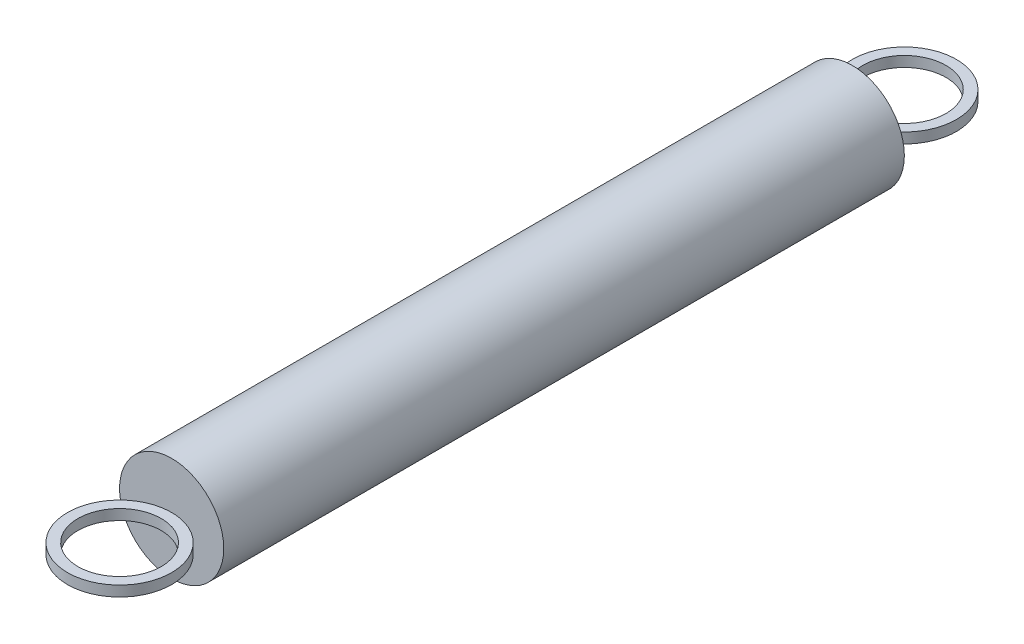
ISO-10303-21;
HEADER;
FILE_DESCRIPTION(('STEP AP214'),'2;1');
FILE_NAME('part.step','',(''),(''),'','','');
FILE_SCHEMA(('AUTOMOTIVE_DESIGN { 1 0 10303 214 1 1 1 1 }'));
ENDSEC;
DATA;
#1=APPLICATION_CONTEXT('core data for automotive mechanical design processes');
#2=APPLICATION_PROTOCOL_DEFINITION('international standard','automotive_design',2000,#1);
#3=PRODUCT_CONTEXT('',#1,'mechanical');
#4=PRODUCT('Part','Part','',(#3));
#5=PRODUCT_RELATED_PRODUCT_CATEGORY('part','',(#4));
#6=PRODUCT_DEFINITION_FORMATION('','',#4);
#7=PRODUCT_DEFINITION_CONTEXT('part definition',#1,'design');
#8=PRODUCT_DEFINITION('design','',#6,#7);
#9=PRODUCT_DEFINITION_SHAPE('','',#8);
#10=(LENGTH_UNIT() NAMED_UNIT(*) SI_UNIT(.MILLI.,.METRE.));
#11=(NAMED_UNIT(*) PLANE_ANGLE_UNIT() SI_UNIT($,.RADIAN.));
#12=(NAMED_UNIT(*) SI_UNIT($,.STERADIAN.) SOLID_ANGLE_UNIT());
#13=UNCERTAINTY_MEASURE_WITH_UNIT(LENGTH_MEASURE(1.E-05),#10,'distance_accuracy_value','');
#14=(GEOMETRIC_REPRESENTATION_CONTEXT(3) GLOBAL_UNCERTAINTY_ASSIGNED_CONTEXT((#13)) GLOBAL_UNIT_ASSIGNED_CONTEXT((#10,
#11,#12)) REPRESENTATION_CONTEXT('',''));
#15=CARTESIAN_POINT('',(0.,0.,0.));
#16=DIRECTION('',(0.,0.,1.));
#17=DIRECTION('',(1.,0.,0.));
#18=AXIS2_PLACEMENT_3D('',#15,#16,#17);
#19=CARTESIAN_POINT('',(0.,0.228599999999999,17.2212));
#20=DIRECTION('',(0.,1.,0.));
#21=DIRECTION('',(0.,0.,1.));
#22=AXIS2_PLACEMENT_3D('',#19,#20,#21);
#23=PLANE('',#22);
#24=CARTESIAN_POINT('',(0.,0.228599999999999,17.2212));
#25=DIRECTION('',(0.,1.,0.));
#26=DIRECTION('',(0.,0.,1.));
#27=AXIS2_PLACEMENT_3D('',#24,#25,#26);
#28=CIRCLE('',#27,2.286);
#29=CARTESIAN_POINT('',(0.,0.228599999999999,19.5072));
#30=VERTEX_POINT('',#29);
#31=EDGE_CURVE('E11',#30,#30,#28,.T.);
#32=ORIENTED_EDGE('',*,*,#31,.T.);
#33=EDGE_LOOP('',(#32));
#34=FACE_BOUND('',#33,.T.);
#35=CARTESIAN_POINT('',(0.,0.228599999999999,17.2212));
#36=DIRECTION('',(0.,1.,0.));
#37=DIRECTION('',(0.,0.,1.));
#38=AXIS2_PLACEMENT_3D('',#35,#36,#37);
#39=CIRCLE('',#38,1.8288);
#40=CARTESIAN_POINT('',(0.,0.228599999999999,19.05));
#41=VERTEX_POINT('',#40);
#42=EDGE_CURVE('E44',#41,#41,#39,.T.);
#43=ORIENTED_EDGE('',*,*,#42,.F.);
#44=EDGE_LOOP('',(#43));
#45=FACE_BOUND('',#44,.T.);
#46=ADVANCED_FACE('F33',(#34,#45),#23,.T.);
#47=CARTESIAN_POINT('',(0.,-0.228600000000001,17.2212));
#48=DIRECTION('',(0.,1.,0.));
#49=DIRECTION('',(0.,0.,1.));
#50=AXIS2_PLACEMENT_3D('',#47,#48,#49);
#51=PLANE('',#50);
#52=CARTESIAN_POINT('',(0.,-0.228600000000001,17.2212));
#53=DIRECTION('',(0.,1.,0.));
#54=DIRECTION('',(0.,0.,1.));
#55=AXIS2_PLACEMENT_3D('',#52,#53,#54);
#56=CIRCLE('',#55,2.286);
#57=CARTESIAN_POINT('',(0.,-0.228600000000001,19.5072));
#58=VERTEX_POINT('',#57);
#59=EDGE_CURVE('E40',#58,#58,#56,.T.);
#60=ORIENTED_EDGE('',*,*,#59,.F.);
#61=EDGE_LOOP('',(#60));
#62=FACE_BOUND('',#61,.T.);
#63=CARTESIAN_POINT('',(0.,-0.228600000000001,17.2212));
#64=DIRECTION('',(0.,1.,0.));
#65=DIRECTION('',(0.,0.,1.));
#66=AXIS2_PLACEMENT_3D('',#63,#64,#65);
#67=CIRCLE('',#66,1.8288);
#68=CARTESIAN_POINT('',(0.,-0.228600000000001,19.05));
#69=VERTEX_POINT('',#68);
#70=EDGE_CURVE('E48',#69,#69,#67,.T.);
#71=ORIENTED_EDGE('',*,*,#70,.T.);
#72=EDGE_LOOP('',(#71));
#73=FACE_BOUND('',#72,.T.);
#74=ADVANCED_FACE('F54',(#62,#73),#51,.F.);
#75=CARTESIAN_POINT('',(0.,0.228599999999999,17.2212));
#76=DIRECTION('',(0.,-1.,0.));
#77=DIRECTION('',(0.,0.,-1.));
#78=AXIS2_PLACEMENT_3D('',#75,#76,#77);
#79=CYLINDRICAL_SURFACE('',#78,2.286);
#80=ORIENTED_EDGE('',*,*,#31,.F.);
#81=EDGE_LOOP('',(#80));
#82=FACE_BOUND('',#81,.T.);
#83=ORIENTED_EDGE('',*,*,#59,.T.);
#84=EDGE_LOOP('',(#83));
#85=FACE_BOUND('',#84,.T.);
#86=ADVANCED_FACE('F35',(#82,#85),#79,.T.);
#87=CARTESIAN_POINT('',(0.,0.228599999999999,17.2212));
#88=DIRECTION('',(0.,-1.,0.));
#89=DIRECTION('',(0.,0.,-1.));
#90=AXIS2_PLACEMENT_3D('',#87,#88,#89);
#91=CYLINDRICAL_SURFACE('',#90,1.8288);
#92=ORIENTED_EDGE('',*,*,#42,.T.);
#93=EDGE_LOOP('',(#92));
#94=FACE_BOUND('',#93,.T.);
#95=ORIENTED_EDGE('',*,*,#70,.F.);
#96=EDGE_LOOP('',(#95));
#97=FACE_BOUND('',#96,.T.);
#98=ADVANCED_FACE('F56',(#94,#97),#91,.F.);
#99=CLOSED_SHELL('',(#46,#74,#86,#98));
#100=MANIFOLD_SOLID_BREP('B2',#99);
#101=CARTESIAN_POINT('',(0.,0.2286,-17.2212));
#102=DIRECTION('',(0.,1.,0.));
#103=DIRECTION('',(0.,0.,1.));
#104=AXIS2_PLACEMENT_3D('',#101,#102,#103);
#105=PLANE('',#104);
#106=CARTESIAN_POINT('',(0.,0.2286,-17.2212));
#107=DIRECTION('',(0.,1.,0.));
#108=DIRECTION('',(0.,0.,1.));
#109=AXIS2_PLACEMENT_3D('',#106,#107,#108);
#110=CIRCLE('',#109,2.286);
#111=CARTESIAN_POINT('',(0.,0.2286,-14.9352));
#112=VERTEX_POINT('',#111);
#113=EDGE_CURVE('E32',#112,#112,#110,.T.);
#114=ORIENTED_EDGE('',*,*,#113,.T.);
#115=EDGE_LOOP('',(#114));
#116=FACE_BOUND('',#115,.T.);
#117=CARTESIAN_POINT('',(0.,0.2286,-17.2212));
#118=DIRECTION('',(0.,1.,0.));
#119=DIRECTION('',(0.,0.,1.));
#120=AXIS2_PLACEMENT_3D('',#117,#118,#119);
#121=CIRCLE('',#120,1.8288);
#122=CARTESIAN_POINT('',(0.,0.2286,-15.3924));
#123=VERTEX_POINT('',#122);
#124=EDGE_CURVE('E96',#123,#123,#121,.T.);
#125=ORIENTED_EDGE('',*,*,#124,.F.);
#126=EDGE_LOOP('',(#125));
#127=FACE_BOUND('',#126,.T.);
#128=ADVANCED_FACE('F85',(#116,#127),#105,.T.);
#129=CARTESIAN_POINT('',(0.,-0.2286,-17.2212));
#130=DIRECTION('',(0.,1.,0.));
#131=DIRECTION('',(0.,0.,1.));
#132=AXIS2_PLACEMENT_3D('',#129,#130,#131);
#133=PLANE('',#132);
#134=CARTESIAN_POINT('',(0.,-0.2286,-17.2212));
#135=DIRECTION('',(0.,1.,0.));
#136=DIRECTION('',(0.,0.,1.));
#137=AXIS2_PLACEMENT_3D('',#134,#135,#136);
#138=CIRCLE('',#137,2.286);
#139=CARTESIAN_POINT('',(0.,-0.2286,-14.9352));
#140=VERTEX_POINT('',#139);
#141=EDGE_CURVE('E92',#140,#140,#138,.T.);
#142=ORIENTED_EDGE('',*,*,#141,.F.);
#143=EDGE_LOOP('',(#142));
#144=FACE_BOUND('',#143,.T.);
#145=CARTESIAN_POINT('',(0.,-0.2286,-17.2212));
#146=DIRECTION('',(0.,1.,0.));
#147=DIRECTION('',(0.,0.,1.));
#148=AXIS2_PLACEMENT_3D('',#145,#146,#147);
#149=CIRCLE('',#148,1.8288);
#150=CARTESIAN_POINT('',(0.,-0.2286,-15.3924));
#151=VERTEX_POINT('',#150);
#152=EDGE_CURVE('E100',#151,#151,#149,.T.);
#153=ORIENTED_EDGE('',*,*,#152,.T.);
#154=EDGE_LOOP('',(#153));
#155=FACE_BOUND('',#154,.T.);
#156=ADVANCED_FACE('F106',(#144,#155),#133,.F.);
#157=CARTESIAN_POINT('',(0.,0.2286,-17.2212));
#158=DIRECTION('',(0.,-1.,0.));
#159=DIRECTION('',(0.,0.,-1.));
#160=AXIS2_PLACEMENT_3D('',#157,#158,#159);
#161=CYLINDRICAL_SURFACE('',#160,2.286);
#162=ORIENTED_EDGE('',*,*,#113,.F.);
#163=EDGE_LOOP('',(#162));
#164=FACE_BOUND('',#163,.T.);
#165=ORIENTED_EDGE('',*,*,#141,.T.);
#166=EDGE_LOOP('',(#165));
#167=FACE_BOUND('',#166,.T.);
#168=ADVANCED_FACE('F87',(#164,#167),#161,.T.);
#169=CARTESIAN_POINT('',(0.,0.2286,-17.2212));
#170=DIRECTION('',(0.,-1.,0.));
#171=DIRECTION('',(0.,0.,-1.));
#172=AXIS2_PLACEMENT_3D('',#169,#170,#171);
#173=CYLINDRICAL_SURFACE('',#172,1.8288);
#174=ORIENTED_EDGE('',*,*,#124,.T.);
#175=EDGE_LOOP('',(#174));
#176=FACE_BOUND('',#175,.T.);
#177=ORIENTED_EDGE('',*,*,#152,.F.);
#178=EDGE_LOOP('',(#177));
#179=FACE_BOUND('',#178,.T.);
#180=ADVANCED_FACE('F108',(#176,#179),#173,.F.);
#181=CLOSED_SHELL('',(#128,#156,#168,#180));
#182=MANIFOLD_SOLID_BREP('B6',#181);
#183=CARTESIAN_POINT('',(0.,0.,14.9352));
#184=DIRECTION('',(0.,0.,-1.));
#185=DIRECTION('',(-1.,0.,0.));
#186=AXIS2_PLACEMENT_3D('',#183,#184,#185);
#187=CYLINDRICAL_SURFACE('',#186,2.286);
#188=CARTESIAN_POINT('',(0.,0.,14.9352));
#189=DIRECTION('',(0.,0.,1.));
#190=DIRECTION('',(1.,0.,0.));
#191=AXIS2_PLACEMENT_3D('',#188,#189,#190);
#192=CIRCLE('',#191,2.286);
#193=CARTESIAN_POINT('',(2.286,0.,14.9352));
#194=VERTEX_POINT('',#193);
#195=EDGE_CURVE('E84',#194,#194,#192,.T.);
#196=ORIENTED_EDGE('',*,*,#195,.F.);
#197=EDGE_LOOP('',(#196));
#198=FACE_BOUND('',#197,.T.);
#199=CARTESIAN_POINT('',(0.,0.,-14.9352));
#200=DIRECTION('',(0.,0.,1.));
#201=DIRECTION('',(1.,0.,0.));
#202=AXIS2_PLACEMENT_3D('',#199,#200,#201);
#203=CIRCLE('',#202,2.286);
#204=CARTESIAN_POINT('',(2.28600000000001,0.,-14.9352));
#205=VERTEX_POINT('',#204);
#206=EDGE_CURVE('E136',#205,#205,#203,.T.);
#207=ORIENTED_EDGE('',*,*,#206,.T.);
#208=EDGE_LOOP('',(#207));
#209=FACE_BOUND('',#208,.T.);
#210=ADVANCED_FACE('F130',(#198,#209),#187,.T.);
#211=CARTESIAN_POINT('',(0.,0.,14.9352));
#212=DIRECTION('',(0.,0.,1.));
#213=DIRECTION('',(1.,0.,0.));
#214=AXIS2_PLACEMENT_3D('',#211,#212,#213);
#215=PLANE('',#214);
#216=ORIENTED_EDGE('',*,*,#195,.T.);
#217=EDGE_LOOP('',(#216));
#218=FACE_BOUND('',#217,.T.);
#219=ADVANCED_FACE('F145',(#218),#215,.T.);
#220=CARTESIAN_POINT('',(0.,0.,-14.9352));
#221=DIRECTION('',(0.,0.,1.));
#222=DIRECTION('',(1.,0.,0.));
#223=AXIS2_PLACEMENT_3D('',#220,#221,#222);
#224=PLANE('',#223);
#225=ORIENTED_EDGE('',*,*,#206,.F.);
#226=EDGE_LOOP('',(#225));
#227=FACE_BOUND('',#226,.T.);
#228=ADVANCED_FACE('F143',(#227),#224,.F.);
#229=CLOSED_SHELL('',(#210,#219,#228));
#230=MANIFOLD_SOLID_BREP('B27',#229);
#231=ADVANCED_BREP_SHAPE_REPRESENTATION('',(#18,#100,#182,#230),#14);
#232=SHAPE_DEFINITION_REPRESENTATION(#9,#231);
ENDSEC;
END-ISO-10303-21;
